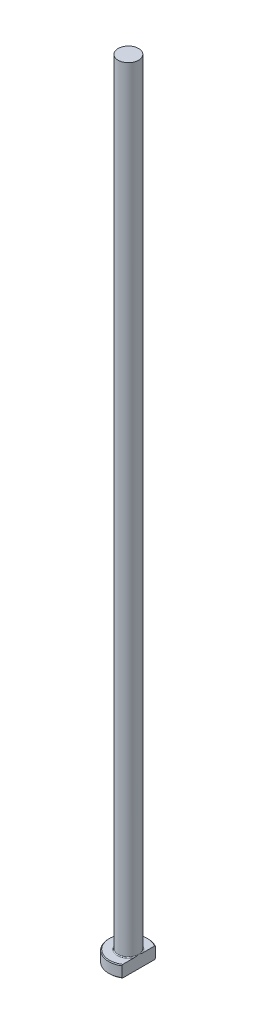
from build123d import *
from build123d.topology import SkipClean

# Parameters (mm, degrees)
CHAMFER1_SIZE = 0.2
FILLET1_R     = 0.2
KEY_DEPTH     = 201.124960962


with BuildPart() as part:
    # Sketch1 → Revolve1 (revolve)
    with BuildSketch(Plane.XY, mode=Mode.PRIVATE) as revolve1_sk:
        Polygon((0, 0), (-5, 0), (-5, 3), (-2.6, 3), (-2.6, 200), (0, 200), align=None)
    revolve(revolve1_sk.sketch.rotate(Axis((0, 259.958771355, 0), (0, -1, 0)), 270), axis=Axis((0, 259.958771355, 0), (0, -1, 0)))

    # Chamfer1
    chamfer1_edges = [part.edges().sort_by_distance(p)[0] for p in [
        (0, 3, -5),
        (0, 0, -5),
    ]]
    chamfer(chamfer1_edges, length=CHAMFER1_SIZE)

    # Fillet1
    fillet1_edges = [part.edges().sort_by_distance(p)[0] for p in [
        (0, 3, -2.6),
    ]]
    fillet(fillet1_edges, radius=FILLET1_R)

    # Sketch2 → KEY (cut, through all)
    with SkipClean():  # the faces are left unmerged after this step: merging them gives an invalid solid
        with BuildSketch(Plane(origin=(0, 0, 0), x_dir=(1, 0, 0), z_dir=(0, 1, 0))):
            with BuildLine():
                Line((2.6, 4.270831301), (2.6, -4.270831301))
                ThreePointArc((2.6, -4.270831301), (5, 0), (2.6, 4.270831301))
            make_face()
        extrude(amount=KEY_DEPTH, mode=Mode.SUBTRACT)


solid = part.part
